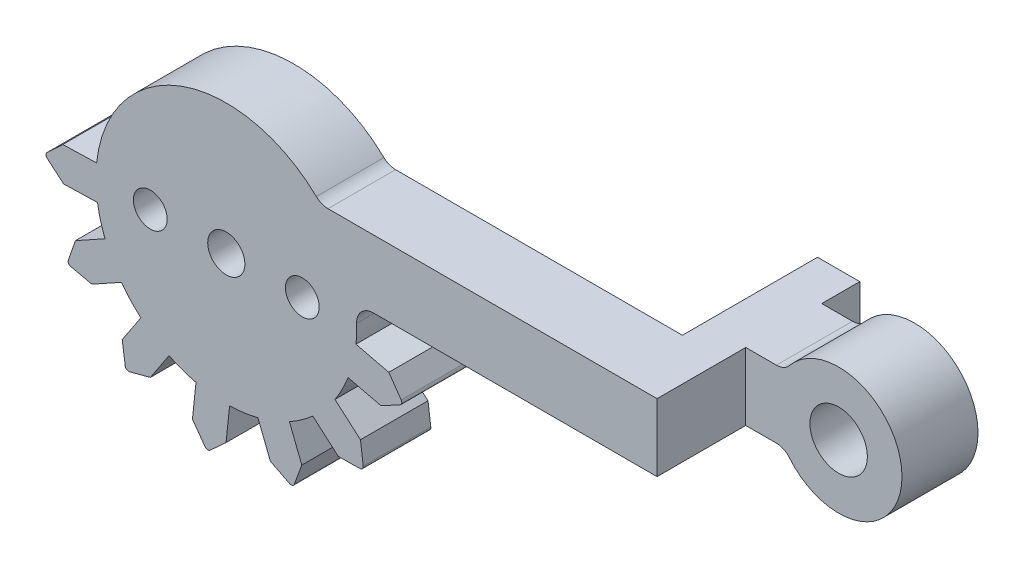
from build123d import *

# Parameters (mm, degrees)
SKETCH1_W            = 2.5
SKETCH1_H            = 4
BOSS_EXTRUDE1_DEPTH  = 4
BOSS_EXTRUDE4_DEPTH  = 4
SKETCH4_R            = 1
SKETCH4_R_2          = 1.1
CUT_EXTRUDE1_DEPTH   = 1
SKETCH4_3_R          = 1
SKETCH4_3_R_2        = 1.1
CUT_EXTRUDE2_DEPTH   = 73.824875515
BOSS_EXTRUDE2_START  = -4
SKETCH1_3_W          = 2.5
SKETCH1_3_H          = 4
BOSS_EXTRUDE2_DEPTH  = 8
BOSS_EXTRUDE5_START  = -7.5
BOSS_EXTRUDE5_DEPTH  = 2.25
M3_CLEARANCE_HOLE1_D = 3.4


with BuildPart() as part:
    # Sketch1 → Boss-Extrude1 (new body)
    with BuildSketch(Plane.XY):
        with BuildLine():
            Line((64.618358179, 25.562177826), (47.639155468, 25.562177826))
            ThreePointArc((47.639155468, 25.562177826), (47.26719517, 25.633929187), (46.948612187, 25.838886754))
            ThreePointArc((46.948612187, 25.838886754), (34.576119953, 17.095359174), (49.332521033, 20.527044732))
            ThreePointArc((49.332521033, 20.527044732), (49.612482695, 21.256752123), (50.331903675, 21.562177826))
            Line((50.331903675, 21.562177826), (64.618358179, 21.562177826))
            Line((64.618358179, 21.562177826), (64.618358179, 25.562177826))
        make_face()
        with Locations((65.868358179, 23.562177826)):
            Rectangle(SKETCH1_W, SKETCH1_H)
    extrude(amount=-BOSS_EXTRUDE1_DEPTH)

    # Sketch3 → Boss-Extrude4 (add)
    with BuildSketch(Plane.XY):
        with BuildLine():
            ThreePointArc((41.812831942, 12.53937692), (40.811510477, 12.579211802), (39.823788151, 12.748433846))
            Line((39.823788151, 12.748433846), (39.614731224, 10.759390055))
            Line((39.614731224, 10.759390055), (40.360701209, 9.71959772))
            ThreePointArc((40.360701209, 9.71959772), (40.502300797, 9.637278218), (40.657921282, 9.688358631))
            Line((40.657921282, 9.688358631), (41.603775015, 10.550333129))
            Line((41.603775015, 10.550333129), (41.812831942, 12.53937692))
        make_face()
        with BuildLine():
            ThreePointArc((45.35393152, 13.501053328), (44.447354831, 13.074028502), (43.493096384, 12.768050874))
            Line((43.493096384, 12.768050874), (44.226098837, 10.907215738))
            Line((44.226098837, 10.907215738), (45.367904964, 10.329359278))
            ThreePointArc((45.367904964, 10.329359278), (45.531516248, 10.321724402), (45.645966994, 10.438890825))
            Line((45.645966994, 10.438890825), (46.086933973, 11.640218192))
            Line((46.086933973, 11.640218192), (45.35393152, 13.501053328))
        make_face()
        with BuildLine():
            ThreePointArc((48.050872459, 15.989168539), (47.443907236, 15.191782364), (46.738754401, 14.479749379))
            Line((46.738754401, 14.479749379), (48.248173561, 13.167631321))
            Line((48.248173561, 13.167631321), (49.527792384, 13.182293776))
            ThreePointArc((49.527792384, 13.182293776), (49.67644276, 13.251068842), (49.723860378, 13.407844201))
            Line((49.723860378, 13.407844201), (49.560291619, 14.677050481))
            Line((49.560291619, 14.677050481), (48.050872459, 15.989168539))
        make_face()
        with BuildLine():
            ThreePointArc((49.29420454, 19.441462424), (49.124011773, 18.453906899), (48.827313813, 17.496722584))
            Line((48.827313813, 17.496722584), (50.772053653, 17.029831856))
            Line((50.772053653, 17.029831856), (51.900319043, 17.63369983))
            ThreePointArc((51.900319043, 17.63369983), (52.000416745, 17.763343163), (51.970085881, 17.924299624))
            Line((51.970085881, 17.924299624), (51.238944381, 18.974571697))
            Line((51.238944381, 18.974571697), (49.29420454, 19.441462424))
        make_face()
        with BuildLine():
            ThreePointArc((38.227785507, 13.321457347), (37.357996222, 13.819150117), (36.560013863, 14.425331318))
            Line((36.560013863, 14.425331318), (35.456139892, 12.757559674))
            Line((35.456139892, 12.757559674), (35.63770068, 11.490802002))
            ThreePointArc((35.63770068, 11.490802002), (35.725290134, 11.352400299), (35.886913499, 11.325851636))
            Line((35.886913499, 11.325851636), (37.123911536, 11.653685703))
            Line((37.123911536, 11.653685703), (38.227785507, 13.321457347))
        make_face()
        with BuildLine():
            ThreePointArc((35.408935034, 15.670561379), (34.867231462, 16.513644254), (34.439315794, 17.419800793))
            Line((34.439315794, 17.419800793), (32.69007638, 16.450181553))
            Line((32.69007638, 16.450181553), (32.266199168, 15.242718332))
            ThreePointArc((32.266199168, 15.242718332), (32.279985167, 15.079510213), (32.411088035, 14.981331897))
            Line((32.411088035, 14.981331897), (33.65969562, 14.700942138))
            Line((33.65969562, 14.700942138), (35.408935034, 15.670561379))
        make_face()
        with BuildLine():
            ThreePointArc((33.993279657, 19.055842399), (33.902075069, 20.053796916), (33.940925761, 21.055157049))
            Line((33.940925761, 21.055157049), (31.941611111, 21.002803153))
            Line((31.941611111, 21.002803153), (31.008082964, 20.12749491))
            ThreePointArc((31.008082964, 20.12749491), (30.944950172, 19.976361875), (31.015906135, 19.828740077))
            Line((31.015906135, 19.828740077), (31.993965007, 19.003488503))
            Line((31.993965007, 19.003488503), (33.993279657, 19.055842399))
        make_face()
    extrude(amount=-BOSS_EXTRUDE4_DEPTH)

    # Sketch4 → Cut-Extrude1 (cut)
    with BuildSketch(Plane(origin=(0, 0, -4), x_dir=(-1, 0, 0), z_dir=(0, 0, -1))):
        with BuildLine():
            Line((-48.118358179, 23.2558549), (-44.972460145, 23.2558549))
            ThreePointArc((-44.972460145, 23.2558549), (-41.618358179, 24.7558549), (-38.264256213, 23.2558549))
            Line((-38.264256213, 23.2558549), (-35.118358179, 23.2558549))
            Line((-35.118358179, 23.2558549), (-35.118358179, 17.2558549))
            Line((-35.118358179, 17.2558549), (-38.264256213, 17.2558549))
            ThreePointArc((-38.264256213, 17.2558549), (-41.618358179, 15.7558549), (-44.972460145, 17.2558549))
            Line((-44.972460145, 17.2558549), (-48.118358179, 17.2558549))
            Line((-48.118358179, 17.2558549), (-48.118358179, 23.2558549))
        make_face()
        with Locations((-37.118358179, 20.2558549)):
            Circle(SKETCH4_R, mode=Mode.SUBTRACT)
        with Locations((-46.118358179, 20.2558549)):
            Circle(SKETCH4_R, mode=Mode.SUBTRACT)
        with Locations((-41.618358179, 20.2558549)):
            Circle(SKETCH4_R_2, mode=Mode.SUBTRACT)
    extrude(amount=-CUT_EXTRUDE1_DEPTH, mode=Mode.SUBTRACT)

    # Sketch4_3 → Cut-Extrude2 (cut, through all)
    with BuildSketch(Plane(origin=(0, 0, -4), x_dir=(-1, 0, 0), z_dir=(0, 0, -1))):
        with Locations((-46.118358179, 20.2558549)):
            Circle(SKETCH4_3_R)
        with Locations((-41.618358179, 20.2558549)):
            Circle(SKETCH4_3_R_2)
        with Locations((-37.118358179, 20.2558549)):
            Circle(SKETCH4_3_R)
    extrude(amount=-CUT_EXTRUDE2_DEPTH, mode=Mode.SUBTRACT)

    # Sketch1_3 → Boss-Extrude2 (add)
    with BuildSketch(Plane.XY.offset(BOSS_EXTRUDE2_START)):
        with Locations((65.868358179, 23.562177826)):
            Rectangle(SKETCH1_3_W, SKETCH1_3_H)
    extrude(amount=-BOSS_EXTRUDE2_DEPTH)

    # Sketch5 → Boss-Extrude5 (add, symmetric)
    with BuildSketch(Plane.XY.offset(BOSS_EXTRUDE5_START)):
        with BuildLine():
            Line((67.118358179, 25.562177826), (68.935628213, 25.562177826))
            ThreePointArc((68.935628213, 25.562177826), (69.364825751, 25.658967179), (69.710939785, 25.930598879))
            ThreePointArc((69.710939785, 25.930598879), (76.368358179, 23.562177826), (69.710939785, 21.193756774))
            ThreePointArc((69.710939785, 21.193756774), (69.364825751, 21.465388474), (68.935628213, 21.562177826))
            Line((68.935628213, 21.562177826), (67.118358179, 21.562177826))
            Line((67.118358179, 21.562177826), (67.118358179, 25.562177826))
        make_face()
    extrude(amount=BOSS_EXTRUDE5_DEPTH, both=True)

    # M3 Clearance Hole1 (through all)
    with Locations(Plane.XY.offset(-5.25)):
        with Locations((72.618358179, 23.562177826)):
            Hole(M3_CLEARANCE_HOLE1_D / 2)


solid = part.part
